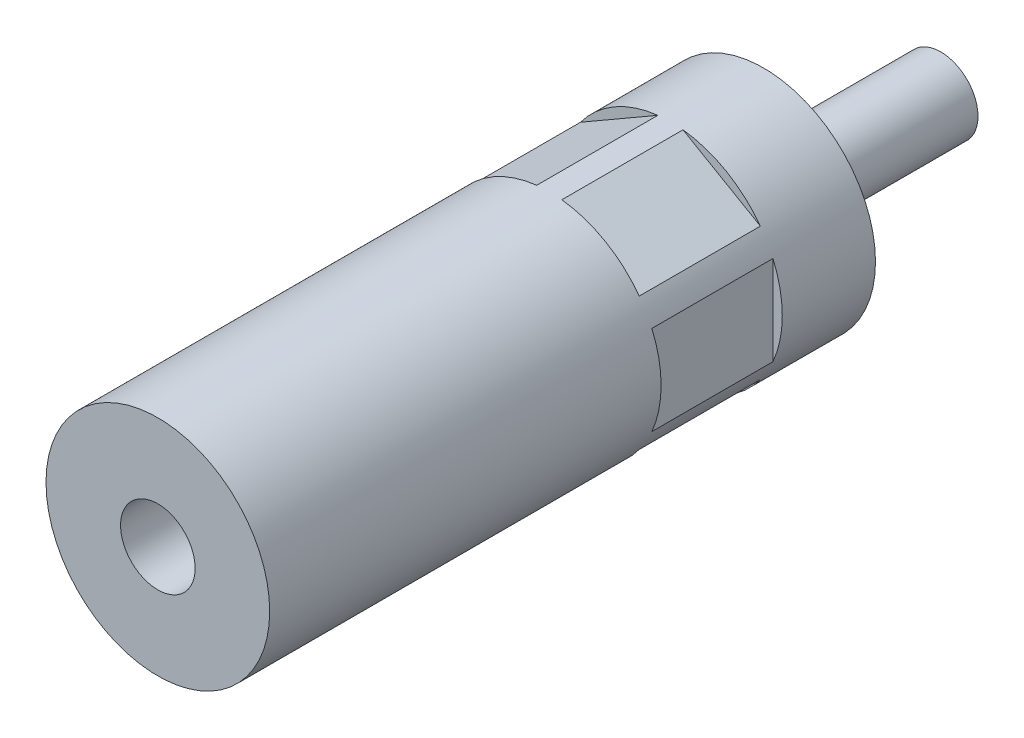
ISO-10303-21;
HEADER;
FILE_DESCRIPTION(('STEP AP214'),'2;1');
FILE_NAME('part.step','',(''),(''),'','','');
FILE_SCHEMA(('AUTOMOTIVE_DESIGN { 1 0 10303 214 1 1 1 1 }'));
ENDSEC;
DATA;
#1=APPLICATION_CONTEXT('core data for automotive mechanical design processes');
#2=APPLICATION_PROTOCOL_DEFINITION('international standard','automotive_design',2000,#1);
#3=PRODUCT_CONTEXT('',#1,'mechanical');
#4=PRODUCT('Part','Part','',(#3));
#5=PRODUCT_RELATED_PRODUCT_CATEGORY('part','',(#4));
#6=PRODUCT_DEFINITION_FORMATION('','',#4);
#7=PRODUCT_DEFINITION_CONTEXT('part definition',#1,'design');
#8=PRODUCT_DEFINITION('design','',#6,#7);
#9=PRODUCT_DEFINITION_SHAPE('','',#8);
#10=(LENGTH_UNIT() NAMED_UNIT(*) SI_UNIT(.MILLI.,.METRE.));
#11=(NAMED_UNIT(*) PLANE_ANGLE_UNIT() SI_UNIT($,.RADIAN.));
#12=(NAMED_UNIT(*) SI_UNIT($,.STERADIAN.) SOLID_ANGLE_UNIT());
#13=UNCERTAINTY_MEASURE_WITH_UNIT(LENGTH_MEASURE(1.E-05),#10,'distance_accuracy_value','');
#14=(GEOMETRIC_REPRESENTATION_CONTEXT(3) GLOBAL_UNCERTAINTY_ASSIGNED_CONTEXT((#13)) GLOBAL_UNIT_ASSIGNED_CONTEXT((#10,
#11,#12)) REPRESENTATION_CONTEXT('',''));
#15=CARTESIAN_POINT('',(0.,0.,0.));
#16=DIRECTION('',(0.,0.,1.));
#17=DIRECTION('',(1.,0.,0.));
#18=AXIS2_PLACEMENT_3D('',#15,#16,#17);
#19=CARTESIAN_POINT('',(0.,0.,80.));
#20=DIRECTION('',(0.,0.,1.));
#21=DIRECTION('',(1.,0.,0.));
#22=AXIS2_PLACEMENT_3D('',#19,#20,#21);
#23=CYLINDRICAL_SURFACE('',#22,12.);
#24=CARTESIAN_POINT('',(0.,0.,10.));
#25=DIRECTION('',(0.,0.,1.));
#26=DIRECTION('',(1.,0.,0.));
#27=AXIS2_PLACEMENT_3D('',#24,#25,#26);
#28=CIRCLE('',#27,12.);
#29=CARTESIAN_POINT('',(-9.653311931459,-7.12836367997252,10.));
#30=VERTEX_POINT('',#29);
#31=CARTESIAN_POINT('',(-1.34668806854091,-11.9241952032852,10.));
#32=VERTEX_POINT('',#31);
#33=EDGE_CURVE('E152',#30,#32,#28,.T.);
#34=ORIENTED_EDGE('',*,*,#33,.F.);
#35=DIRECTION('',(0.,0.,1.));
#36=VECTOR('',#35,1.);
#37=CARTESIAN_POINT('',(-9.65331193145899,-7.12836367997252,80.));
#38=LINE('',#37,#36);
#39=CARTESIAN_POINT('',(-9.653311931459,-7.12836367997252,23.));
#40=VERTEX_POINT('',#39);
#41=EDGE_CURVE('E9',#30,#40,#38,.T.);
#42=ORIENTED_EDGE('',*,*,#41,.T.);
#43=CARTESIAN_POINT('',(0.,0.,23.));
#44=DIRECTION('',(0.,0.,1.));
#45=DIRECTION('',(1.,0.,0.));
#46=AXIS2_PLACEMENT_3D('',#43,#44,#45);
#47=CIRCLE('',#46,12.);
#48=CARTESIAN_POINT('',(-1.34668806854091,-11.9241952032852,23.));
#49=VERTEX_POINT('',#48);
#50=EDGE_CURVE('E22',#40,#49,#47,.T.);
#51=ORIENTED_EDGE('',*,*,#50,.T.);
#52=DIRECTION('',(0.,0.,1.));
#53=VECTOR('',#52,1.);
#54=CARTESIAN_POINT('',(-1.34668806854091,-11.9241952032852,80.));
#55=LINE('',#54,#53);
#56=EDGE_CURVE('E149',#49,#32,#55,.F.);
#57=ORIENTED_EDGE('',*,*,#56,.T.);
#58=EDGE_LOOP('',(#34,#42,#51,#57));
#59=FACE_BOUND('',#58,.T.);
#60=DIRECTION('',(0.,0.,1.));
#61=VECTOR('',#60,1.);
#62=CARTESIAN_POINT('',(11.,4.79583152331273,80.));
#63=LINE('',#62,#61);
#64=CARTESIAN_POINT('',(11.,4.79583152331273,10.));
#65=VERTEX_POINT('',#64);
#66=CARTESIAN_POINT('',(11.,4.79583152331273,23.));
#67=VERTEX_POINT('',#66);
#68=EDGE_CURVE('E142',#65,#67,#63,.T.);
#69=ORIENTED_EDGE('',*,*,#68,.F.);
#70=CARTESIAN_POINT('',(11.,-4.79583152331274,10.));
#71=VERTEX_POINT('',#70);
#72=EDGE_CURVE('E141',#71,#65,#28,.T.);
#73=ORIENTED_EDGE('',*,*,#72,.F.);
#74=DIRECTION('',(0.,0.,1.));
#75=VECTOR('',#74,1.);
#76=CARTESIAN_POINT('',(11.,-4.79583152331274,80.));
#77=LINE('',#76,#75);
#78=CARTESIAN_POINT('',(11.,-4.79583152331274,23.));
#79=VERTEX_POINT('',#78);
#80=EDGE_CURVE('E138',#79,#71,#77,.F.);
#81=ORIENTED_EDGE('',*,*,#80,.F.);
#82=EDGE_CURVE('E145',#79,#67,#47,.T.);
#83=ORIENTED_EDGE('',*,*,#82,.T.);
#84=EDGE_LOOP('',(#69,#73,#81,#83));
#85=FACE_BOUND('',#84,.T.);
#86=CARTESIAN_POINT('',(9.65331193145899,7.12836367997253,10.));
#87=VERTEX_POINT('',#86);
#88=CARTESIAN_POINT('',(1.34668806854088,11.9241952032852,10.));
#89=VERTEX_POINT('',#88);
#90=EDGE_CURVE('E134',#87,#89,#28,.T.);
#91=ORIENTED_EDGE('',*,*,#90,.F.);
#92=DIRECTION('',(0.,0.,1.));
#93=VECTOR('',#92,1.);
#94=CARTESIAN_POINT('',(9.65331193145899,7.12836367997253,80.));
#95=LINE('',#94,#93);
#96=CARTESIAN_POINT('',(9.65331193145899,7.12836367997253,23.));
#97=VERTEX_POINT('',#96);
#98=EDGE_CURVE('E135',#87,#97,#95,.T.);
#99=ORIENTED_EDGE('',*,*,#98,.T.);
#100=CARTESIAN_POINT('',(1.34668806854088,11.9241952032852,23.));
#101=VERTEX_POINT('',#100);
#102=EDGE_CURVE('E139',#97,#101,#47,.T.);
#103=ORIENTED_EDGE('',*,*,#102,.T.);
#104=DIRECTION('',(0.,0.,1.));
#105=VECTOR('',#104,1.);
#106=CARTESIAN_POINT('',(1.34668806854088,11.9241952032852,80.));
#107=LINE('',#106,#105);
#108=EDGE_CURVE('E131',#101,#89,#107,.F.);
#109=ORIENTED_EDGE('',*,*,#108,.T.);
#110=EDGE_LOOP('',(#91,#99,#103,#109));
#111=FACE_BOUND('',#110,.T.);
#112=CARTESIAN_POINT('',(0.,0.,0.));
#113=DIRECTION('',(0.,0.,1.));
#114=DIRECTION('',(1.,0.,0.));
#115=AXIS2_PLACEMENT_3D('',#112,#113,#114);
#116=CIRCLE('',#115,12.);
#117=CARTESIAN_POINT('',(12.,0.,0.));
#118=VERTEX_POINT('',#117);
#119=EDGE_CURVE('E204',#118,#118,#116,.T.);
#120=ORIENTED_EDGE('',*,*,#119,.T.);
#121=EDGE_LOOP('',(#120));
#122=FACE_BOUND('',#121,.T.);
#123=CARTESIAN_POINT('',(0.,0.,65.));
#124=DIRECTION('',(0.,0.,1.));
#125=DIRECTION('',(1.,0.,0.));
#126=AXIS2_PLACEMENT_3D('',#123,#124,#125);
#127=CIRCLE('',#126,12.);
#128=CARTESIAN_POINT('',(12.,0.,65.));
#129=VERTEX_POINT('',#128);
#130=EDGE_CURVE('E201',#129,#129,#127,.T.);
#131=ORIENTED_EDGE('',*,*,#130,.F.);
#132=EDGE_LOOP('',(#131));
#133=FACE_BOUND('',#132,.T.);
#134=CARTESIAN_POINT('',(-11.,4.79583152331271,10.));
#135=VERTEX_POINT('',#134);
#136=CARTESIAN_POINT('',(-11.,-4.79583152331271,10.));
#137=VERTEX_POINT('',#136);
#138=EDGE_CURVE('E111',#135,#137,#28,.T.);
#139=ORIENTED_EDGE('',*,*,#138,.F.);
#140=DIRECTION('',(0.,0.,1.));
#141=VECTOR('',#140,1.);
#142=CARTESIAN_POINT('',(-11.,4.79583152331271,80.));
#143=LINE('',#142,#141);
#144=CARTESIAN_POINT('',(-11.,4.79583152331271,23.));
#145=VERTEX_POINT('',#144);
#146=EDGE_CURVE('E110',#135,#145,#143,.T.);
#147=ORIENTED_EDGE('',*,*,#146,.T.);
#148=CARTESIAN_POINT('',(-11.,-4.79583152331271,23.));
#149=VERTEX_POINT('',#148);
#150=EDGE_CURVE('E103',#145,#149,#47,.T.);
#151=ORIENTED_EDGE('',*,*,#150,.T.);
#152=DIRECTION('',(0.,0.,1.));
#153=VECTOR('',#152,1.);
#154=CARTESIAN_POINT('',(-11.,-4.79583152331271,80.));
#155=LINE('',#154,#153);
#156=EDGE_CURVE('E117',#149,#137,#155,.F.);
#157=ORIENTED_EDGE('',*,*,#156,.T.);
#158=EDGE_LOOP('',(#139,#147,#151,#157));
#159=FACE_BOUND('',#158,.T.);
#160=DIRECTION('',(0.,0.,1.));
#161=VECTOR('',#160,1.);
#162=CARTESIAN_POINT('',(-9.65331193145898,7.12836367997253,80.));
#163=LINE('',#162,#161);
#164=CARTESIAN_POINT('',(-9.65331193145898,7.12836367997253,10.));
#165=VERTEX_POINT('',#164);
#166=CARTESIAN_POINT('',(-9.65331193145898,7.12836367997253,23.));
#167=VERTEX_POINT('',#166);
#168=EDGE_CURVE('E129',#165,#167,#163,.T.);
#169=ORIENTED_EDGE('',*,*,#168,.F.);
#170=CARTESIAN_POINT('',(-1.3466880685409,11.9241952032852,10.));
#171=VERTEX_POINT('',#170);
#172=EDGE_CURVE('E125',#171,#165,#28,.T.);
#173=ORIENTED_EDGE('',*,*,#172,.F.);
#174=DIRECTION('',(0.,0.,1.));
#175=VECTOR('',#174,1.);
#176=CARTESIAN_POINT('',(-1.3466880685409,11.9241952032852,80.));
#177=LINE('',#176,#175);
#178=CARTESIAN_POINT('',(-1.3466880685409,11.9241952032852,23.));
#179=VERTEX_POINT('',#178);
#180=EDGE_CURVE('E123',#179,#171,#177,.F.);
#181=ORIENTED_EDGE('',*,*,#180,.F.);
#182=EDGE_CURVE('E113',#179,#167,#47,.T.);
#183=ORIENTED_EDGE('',*,*,#182,.T.);
#184=EDGE_LOOP('',(#169,#173,#181,#183));
#185=FACE_BOUND('',#184,.T.);
#186=DIRECTION('',(0.,0.,1.));
#187=VECTOR('',#186,1.);
#188=CARTESIAN_POINT('',(9.65331193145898,-7.12836367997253,80.));
#189=LINE('',#188,#187);
#190=CARTESIAN_POINT('',(9.65331193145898,-7.12836367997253,10.));
#191=VERTEX_POINT('',#190);
#192=CARTESIAN_POINT('',(9.65331193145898,-7.12836367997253,23.));
#193=VERTEX_POINT('',#192);
#194=EDGE_CURVE('E148',#191,#193,#189,.T.);
#195=ORIENTED_EDGE('',*,*,#194,.F.);
#196=CARTESIAN_POINT('',(1.34668806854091,-11.9241952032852,10.));
#197=VERTEX_POINT('',#196);
#198=EDGE_CURVE('E147',#197,#191,#28,.T.);
#199=ORIENTED_EDGE('',*,*,#198,.F.);
#200=DIRECTION('',(0.,0.,1.));
#201=VECTOR('',#200,1.);
#202=CARTESIAN_POINT('',(1.34668806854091,-11.9241952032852,80.));
#203=LINE('',#202,#201);
#204=CARTESIAN_POINT('',(1.34668806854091,-11.9241952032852,23.));
#205=VERTEX_POINT('',#204);
#206=EDGE_CURVE('E144',#205,#197,#203,.F.);
#207=ORIENTED_EDGE('',*,*,#206,.F.);
#208=EDGE_CURVE('E150',#205,#193,#47,.T.);
#209=ORIENTED_EDGE('',*,*,#208,.T.);
#210=EDGE_LOOP('',(#195,#199,#207,#209));
#211=FACE_BOUND('',#210,.T.);
#212=ADVANCED_FACE('F14',(#59,#85,#111,#122,#133,#159,#185,#211),#23,.T.);
#213=CARTESIAN_POINT('',(0.,0.,-19.));
#214=DIRECTION('',(0.,0.,1.));
#215=DIRECTION('',(1.,0.,0.));
#216=AXIS2_PLACEMENT_3D('',#213,#214,#215);
#217=PLANE('',#216);
#218=CARTESIAN_POINT('',(0.,0.,-19.));
#219=DIRECTION('',(0.,0.,1.));
#220=DIRECTION('',(1.,0.,0.));
#221=AXIS2_PLACEMENT_3D('',#218,#219,#220);
#222=CIRCLE('',#221,4.);
#223=CARTESIAN_POINT('',(4.,0.,-19.));
#224=VERTEX_POINT('',#223);
#225=EDGE_CURVE('E159',#224,#224,#222,.T.);
#226=ORIENTED_EDGE('',*,*,#225,.F.);
#227=EDGE_LOOP('',(#226));
#228=FACE_BOUND('',#227,.T.);
#229=ADVANCED_FACE('F16',(#228),#217,.F.);
#230=CARTESIAN_POINT('',(0.,0.,80.));
#231=DIRECTION('',(0.,0.,1.));
#232=DIRECTION('',(1.,0.,0.));
#233=AXIS2_PLACEMENT_3D('',#230,#231,#232);
#234=CYLINDRICAL_SURFACE('',#233,4.);
#235=CARTESIAN_POINT('',(0.,0.,-2.5));
#236=DIRECTION('',(0.,0.,1.));
#237=DIRECTION('',(1.,0.,0.));
#238=AXIS2_PLACEMENT_3D('',#235,#236,#237);
#239=CIRCLE('',#238,4.);
#240=CARTESIAN_POINT('',(4.,0.,-2.5));
#241=VERTEX_POINT('',#240);
#242=EDGE_CURVE('E213',#241,#241,#239,.T.);
#243=ORIENTED_EDGE('',*,*,#242,.F.);
#244=EDGE_LOOP('',(#243));
#245=FACE_BOUND('',#244,.T.);
#246=ORIENTED_EDGE('',*,*,#225,.T.);
#247=EDGE_LOOP('',(#246));
#248=FACE_BOUND('',#247,.T.);
#249=ADVANCED_FACE('F219',(#245,#248),#234,.T.);
#250=CARTESIAN_POINT('',(3.25,0.,-2.5));
#251=DIRECTION('',(0.,0.,1.));
#252=DIRECTION('',(1.,0.,0.));
#253=AXIS2_PLACEMENT_3D('',#250,#251,#252);
#254=PLANE('',#253);
#255=ORIENTED_EDGE('',*,*,#242,.T.);
#256=EDGE_LOOP('',(#255));
#257=FACE_BOUND('',#256,.T.);
#258=CARTESIAN_POINT('',(0.,0.,-2.5));
#259=DIRECTION('',(0.,0.,1.));
#260=DIRECTION('',(1.,0.,0.));
#261=AXIS2_PLACEMENT_3D('',#258,#259,#260);
#262=CIRCLE('',#261,3.25);
#263=CARTESIAN_POINT('',(3.25,0.,-2.5));
#264=VERTEX_POINT('',#263);
#265=EDGE_CURVE('E210',#264,#264,#262,.T.);
#266=ORIENTED_EDGE('',*,*,#265,.F.);
#267=EDGE_LOOP('',(#266));
#268=FACE_BOUND('',#267,.T.);
#269=ADVANCED_FACE('F227',(#257,#268),#254,.T.);
#270=CARTESIAN_POINT('',(0.,0.,80.));
#271=DIRECTION('',(0.,0.,1.));
#272=DIRECTION('',(1.,0.,0.));
#273=AXIS2_PLACEMENT_3D('',#270,#271,#272);
#274=CYLINDRICAL_SURFACE('',#273,3.25);
#275=ORIENTED_EDGE('',*,*,#265,.T.);
#276=EDGE_LOOP('',(#275));
#277=FACE_BOUND('',#276,.T.);
#278=CARTESIAN_POINT('',(0.,0.,0.));
#279=DIRECTION('',(0.,0.,1.));
#280=DIRECTION('',(1.,0.,0.));
#281=AXIS2_PLACEMENT_3D('',#278,#279,#280);
#282=CIRCLE('',#281,3.25);
#283=CARTESIAN_POINT('',(3.25,0.,0.));
#284=VERTEX_POINT('',#283);
#285=EDGE_CURVE('E207',#284,#284,#282,.T.);
#286=ORIENTED_EDGE('',*,*,#285,.F.);
#287=EDGE_LOOP('',(#286));
#288=FACE_BOUND('',#287,.T.);
#289=ADVANCED_FACE('F239',(#277,#288),#274,.T.);
#290=CARTESIAN_POINT('',(12.,0.,0.));
#291=DIRECTION('',(0.,0.,-1.));
#292=DIRECTION('',(-1.,0.,0.));
#293=AXIS2_PLACEMENT_3D('',#290,#291,#292);
#294=PLANE('',#293);
#295=ORIENTED_EDGE('',*,*,#285,.T.);
#296=EDGE_LOOP('',(#295));
#297=FACE_BOUND('',#296,.T.);
#298=ORIENTED_EDGE('',*,*,#119,.F.);
#299=EDGE_LOOP('',(#298));
#300=FACE_BOUND('',#299,.T.);
#301=ADVANCED_FACE('F236',(#297,#300),#294,.T.);
#302=CARTESIAN_POINT('',(12.,0.,65.));
#303=DIRECTION('',(0.,0.,-1.));
#304=DIRECTION('',(-1.,0.,0.));
#305=AXIS2_PLACEMENT_3D('',#302,#303,#304);
#306=PLANE('',#305);
#307=CARTESIAN_POINT('',(0.,0.,65.));
#308=DIRECTION('',(0.,0.,1.));
#309=DIRECTION('',(1.,0.,0.));
#310=AXIS2_PLACEMENT_3D('',#307,#308,#309);
#311=CIRCLE('',#310,4.);
#312=CARTESIAN_POINT('',(4.,0.,65.));
#313=VERTEX_POINT('',#312);
#314=EDGE_CURVE('E190',#313,#313,#311,.T.);
#315=ORIENTED_EDGE('',*,*,#314,.F.);
#316=EDGE_LOOP('',(#315));
#317=FACE_BOUND('',#316,.T.);
#318=ORIENTED_EDGE('',*,*,#130,.T.);
#319=EDGE_LOOP('',(#318));
#320=FACE_BOUND('',#319,.T.);
#321=ADVANCED_FACE('F234',(#317,#320),#306,.F.);
#322=CARTESIAN_POINT('',(0.,0.,80.));
#323=DIRECTION('',(0.,0.,1.));
#324=DIRECTION('',(1.,0.,0.));
#325=AXIS2_PLACEMENT_3D('',#322,#323,#324);
#326=CYLINDRICAL_SURFACE('',#325,4.);
#327=CARTESIAN_POINT('',(0.,0.,45.));
#328=DIRECTION('',(0.,0.,1.));
#329=DIRECTION('',(1.,0.,0.));
#330=AXIS2_PLACEMENT_3D('',#327,#328,#329);
#331=CIRCLE('',#330,4.);
#332=CARTESIAN_POINT('',(4.,0.,45.));
#333=VERTEX_POINT('',#332);
#334=EDGE_CURVE('E312',#333,#333,#331,.T.);
#335=ORIENTED_EDGE('',*,*,#334,.F.);
#336=EDGE_LOOP('',(#335));
#337=FACE_BOUND('',#336,.T.);
#338=ORIENTED_EDGE('',*,*,#314,.T.);
#339=EDGE_LOOP('',(#338));
#340=FACE_BOUND('',#339,.T.);
#341=ADVANCED_FACE('F260',(#337,#340),#326,.F.);
#342=CARTESIAN_POINT('',(-11.,6.35085296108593,23.));
#343=DIRECTION('',(1.,0.,0.));
#344=DIRECTION('',(0.,0.,-1.));
#345=AXIS2_PLACEMENT_3D('',#342,#343,#344);
#346=PLANE('',#345);
#347=DIRECTION('',(0.,-1.,0.));
#348=VECTOR('',#347,1.);
#349=CARTESIAN_POINT('',(-11.,6.35085296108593,10.));
#350=LINE('',#349,#348);
#351=EDGE_CURVE('E313',#135,#137,#350,.T.);
#352=ORIENTED_EDGE('',*,*,#351,.T.);
#353=ORIENTED_EDGE('',*,*,#156,.F.);
#354=DIRECTION('',(0.,-1.,0.));
#355=VECTOR('',#354,1.);
#356=CARTESIAN_POINT('',(-11.,6.35085296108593,23.));
#357=LINE('',#356,#355);
#358=EDGE_CURVE('E106',#145,#149,#357,.T.);
#359=ORIENTED_EDGE('',*,*,#358,.F.);
#360=ORIENTED_EDGE('',*,*,#146,.F.);
#361=EDGE_LOOP('',(#352,#353,#359,#360));
#362=FACE_BOUND('',#361,.T.);
#363=ADVANCED_FACE('F115',(#362),#346,.F.);
#364=CARTESIAN_POINT('',(0.,0.,10.));
#365=DIRECTION('',(0.,0.,1.));
#366=DIRECTION('',(1.,0.,0.));
#367=AXIS2_PLACEMENT_3D('',#364,#365,#366);
#368=PLANE('',#367);
#369=ORIENTED_EDGE('',*,*,#138,.T.);
#370=ORIENTED_EDGE('',*,*,#351,.F.);
#371=EDGE_LOOP('',(#369,#370));
#372=FACE_BOUND('',#371,.T.);
#373=ADVANCED_FACE('F271',(#372),#368,.T.);
#374=CARTESIAN_POINT('',(0.,0.,23.));
#375=DIRECTION('',(0.,0.,1.));
#376=DIRECTION('',(1.,0.,0.));
#377=AXIS2_PLACEMENT_3D('',#374,#375,#376);
#378=PLANE('',#377);
#379=ORIENTED_EDGE('',*,*,#358,.T.);
#380=ORIENTED_EDGE('',*,*,#150,.F.);
#381=EDGE_LOOP('',(#379,#380));
#382=FACE_BOUND('',#381,.T.);
#383=ADVANCED_FACE('F105',(#382),#378,.F.);
#384=CARTESIAN_POINT('',(-11.,6.35085296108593,23.));
#385=DIRECTION('',(-0.5,0.866025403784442,0.));
#386=DIRECTION('',(-0.866025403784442,-0.5,0.));
#387=AXIS2_PLACEMENT_3D('',#384,#385,#386);
#388=PLANE('',#387);
#389=ORIENTED_EDGE('',*,*,#168,.T.);
#390=DIRECTION('',(0.866025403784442,0.5,0.));
#391=VECTOR('',#390,1.);
#392=CARTESIAN_POINT('',(-11.,6.35085296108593,23.));
#393=LINE('',#392,#391);
#394=EDGE_CURVE('E118',#167,#179,#393,.T.);
#395=ORIENTED_EDGE('',*,*,#394,.T.);
#396=ORIENTED_EDGE('',*,*,#180,.T.);
#397=DIRECTION('',(0.866025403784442,0.5,0.));
#398=VECTOR('',#397,1.);
#399=CARTESIAN_POINT('',(-11.,6.35085296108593,10.));
#400=LINE('',#399,#398);
#401=EDGE_CURVE('E315',#165,#171,#400,.T.);
#402=ORIENTED_EDGE('',*,*,#401,.F.);
#403=EDGE_LOOP('',(#389,#395,#396,#402));
#404=FACE_BOUND('',#403,.T.);
#405=ADVANCED_FACE('F298',(#404),#388,.T.);
#406=ORIENTED_EDGE('',*,*,#172,.T.);
#407=ORIENTED_EDGE('',*,*,#401,.T.);
#408=EDGE_LOOP('',(#406,#407));
#409=FACE_BOUND('',#408,.T.);
#410=ADVANCED_FACE('F286',(#409),#368,.T.);
#411=ORIENTED_EDGE('',*,*,#394,.F.);
#412=ORIENTED_EDGE('',*,*,#182,.F.);
#413=EDGE_LOOP('',(#411,#412));
#414=FACE_BOUND('',#413,.T.);
#415=ADVANCED_FACE('F281',(#414),#378,.F.);
#416=CARTESIAN_POINT('',(11.,6.35085296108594,23.));
#417=DIRECTION('',(-0.499999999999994,-0.866025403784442,0.));
#418=DIRECTION('',(0.866025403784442,-0.499999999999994,0.));
#419=AXIS2_PLACEMENT_3D('',#416,#417,#418);
#420=PLANE('',#419);
#421=DIRECTION('',(-0.866025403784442,0.499999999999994,0.));
#422=VECTOR('',#421,1.);
#423=CARTESIAN_POINT('',(11.,6.35085296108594,10.));
#424=LINE('',#423,#422);
#425=EDGE_CURVE('E323',#87,#89,#424,.T.);
#426=ORIENTED_EDGE('',*,*,#425,.T.);
#427=ORIENTED_EDGE('',*,*,#108,.F.);
#428=DIRECTION('',(-0.866025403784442,0.499999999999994,0.));
#429=VECTOR('',#428,1.);
#430=CARTESIAN_POINT('',(11.,6.35085296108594,23.));
#431=LINE('',#430,#429);
#432=EDGE_CURVE('E192',#97,#101,#431,.T.);
#433=ORIENTED_EDGE('',*,*,#432,.F.);
#434=ORIENTED_EDGE('',*,*,#98,.F.);
#435=EDGE_LOOP('',(#426,#427,#433,#434));
#436=FACE_BOUND('',#435,.T.);
#437=ADVANCED_FACE('F285',(#436),#420,.F.);
#438=ORIENTED_EDGE('',*,*,#90,.T.);
#439=ORIENTED_EDGE('',*,*,#425,.F.);
#440=EDGE_LOOP('',(#438,#439));
#441=FACE_BOUND('',#440,.T.);
#442=ADVANCED_FACE('F279',(#441),#368,.T.);
#443=ORIENTED_EDGE('',*,*,#432,.T.);
#444=ORIENTED_EDGE('',*,*,#102,.F.);
#445=EDGE_LOOP('',(#443,#444));
#446=FACE_BOUND('',#445,.T.);
#447=ADVANCED_FACE('F275',(#446),#378,.F.);
#448=CARTESIAN_POINT('',(11.,6.35085296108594,23.));
#449=DIRECTION('',(1.,0.,0.));
#450=DIRECTION('',(0.,1.,0.));
#451=AXIS2_PLACEMENT_3D('',#448,#449,#450);
#452=PLANE('',#451);
#453=ORIENTED_EDGE('',*,*,#68,.T.);
#454=DIRECTION('',(0.,-1.,0.));
#455=VECTOR('',#454,1.);
#456=CARTESIAN_POINT('',(11.,6.35085296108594,23.));
#457=LINE('',#456,#455);
#458=EDGE_CURVE('E187',#67,#79,#457,.T.);
#459=ORIENTED_EDGE('',*,*,#458,.T.);
#460=ORIENTED_EDGE('',*,*,#80,.T.);
#461=DIRECTION('',(0.,-1.,0.));
#462=VECTOR('',#461,1.);
#463=CARTESIAN_POINT('',(11.,6.35085296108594,10.));
#464=LINE('',#463,#462);
#465=EDGE_CURVE('E322',#65,#71,#464,.T.);
#466=ORIENTED_EDGE('',*,*,#465,.F.);
#467=EDGE_LOOP('',(#453,#459,#460,#466));
#468=FACE_BOUND('',#467,.T.);
#469=ADVANCED_FACE('F278',(#468),#452,.T.);
#470=ORIENTED_EDGE('',*,*,#72,.T.);
#471=ORIENTED_EDGE('',*,*,#465,.T.);
#472=EDGE_LOOP('',(#470,#471));
#473=FACE_BOUND('',#472,.T.);
#474=ADVANCED_FACE('F287',(#473),#368,.T.);
#475=ORIENTED_EDGE('',*,*,#458,.F.);
#476=ORIENTED_EDGE('',*,*,#82,.F.);
#477=EDGE_LOOP('',(#475,#476));
#478=FACE_BOUND('',#477,.T.);
#479=ADVANCED_FACE('F282',(#478),#378,.F.);
#480=CARTESIAN_POINT('',(11.,-6.35085296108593,23.));
#481=DIRECTION('',(0.5,-0.866025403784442,0.));
#482=DIRECTION('',(0.866025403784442,0.5,0.));
#483=AXIS2_PLACEMENT_3D('',#480,#481,#482);
#484=PLANE('',#483);
#485=ORIENTED_EDGE('',*,*,#194,.T.);
#486=DIRECTION('',(-0.866025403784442,-0.5,0.));
#487=VECTOR('',#486,1.);
#488=CARTESIAN_POINT('',(11.,-6.35085296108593,23.));
#489=LINE('',#488,#487);
#490=EDGE_CURVE('E37',#193,#205,#489,.T.);
#491=ORIENTED_EDGE('',*,*,#490,.T.);
#492=ORIENTED_EDGE('',*,*,#206,.T.);
#493=DIRECTION('',(-0.866025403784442,-0.5,0.));
#494=VECTOR('',#493,1.);
#495=CARTESIAN_POINT('',(11.,-6.35085296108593,10.));
#496=LINE('',#495,#494);
#497=EDGE_CURVE('E319',#191,#197,#496,.T.);
#498=ORIENTED_EDGE('',*,*,#497,.F.);
#499=EDGE_LOOP('',(#485,#491,#492,#498));
#500=FACE_BOUND('',#499,.T.);
#501=ADVANCED_FACE('F288',(#500),#484,.T.);
#502=ORIENTED_EDGE('',*,*,#198,.T.);
#503=ORIENTED_EDGE('',*,*,#497,.T.);
#504=EDGE_LOOP('',(#502,#503));
#505=FACE_BOUND('',#504,.T.);
#506=ADVANCED_FACE('F291',(#505),#368,.T.);
#507=ORIENTED_EDGE('',*,*,#490,.F.);
#508=ORIENTED_EDGE('',*,*,#208,.F.);
#509=EDGE_LOOP('',(#507,#508));
#510=FACE_BOUND('',#509,.T.);
#511=ADVANCED_FACE('F185',(#510),#378,.F.);
#512=DIRECTION('',(0.866025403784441,-0.5,0.));
#513=VECTOR('',#512,1.);
#514=CARTESIAN_POINT('',(-11.,-6.35085296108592,23.));
#515=LINE('',#514,#513);
#516=EDGE_CURVE('E186',#40,#49,#515,.T.);
#517=ORIENTED_EDGE('',*,*,#516,.T.);
#518=ORIENTED_EDGE('',*,*,#50,.F.);
#519=EDGE_LOOP('',(#517,#518));
#520=FACE_BOUND('',#519,.T.);
#521=ADVANCED_FACE('F335',(#520),#378,.F.);
#522=ORIENTED_EDGE('',*,*,#33,.T.);
#523=DIRECTION('',(0.866025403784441,-0.5,0.));
#524=VECTOR('',#523,1.);
#525=CARTESIAN_POINT('',(-11.,-6.35085296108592,10.));
#526=LINE('',#525,#524);
#527=EDGE_CURVE('E29',#30,#32,#526,.T.);
#528=ORIENTED_EDGE('',*,*,#527,.F.);
#529=EDGE_LOOP('',(#522,#528));
#530=FACE_BOUND('',#529,.T.);
#531=ADVANCED_FACE('F306',(#530),#368,.T.);
#532=CARTESIAN_POINT('',(-11.,-6.35085296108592,23.));
#533=DIRECTION('',(0.5,0.866025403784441,0.));
#534=DIRECTION('',(-0.866025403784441,0.5,0.));
#535=AXIS2_PLACEMENT_3D('',#532,#533,#534);
#536=PLANE('',#535);
#537=ORIENTED_EDGE('',*,*,#527,.T.);
#538=ORIENTED_EDGE('',*,*,#56,.F.);
#539=ORIENTED_EDGE('',*,*,#516,.F.);
#540=ORIENTED_EDGE('',*,*,#41,.F.);
#541=EDGE_LOOP('',(#537,#538,#539,#540));
#542=FACE_BOUND('',#541,.T.);
#543=ADVANCED_FACE('F302',(#542),#536,.F.);
#544=CARTESIAN_POINT('',(0.,0.,45.));
#545=DIRECTION('',(0.,0.,1.));
#546=DIRECTION('',(1.,0.,0.));
#547=AXIS2_PLACEMENT_3D('',#544,#545,#546);
#548=PLANE('',#547);
#549=ORIENTED_EDGE('',*,*,#334,.T.);
#550=EDGE_LOOP('',(#549));
#551=FACE_BOUND('',#550,.T.);
#552=ADVANCED_FACE('F305',(#551),#548,.T.);
#553=CLOSED_SHELL('',(#212,#229,#249,#269,#289,#301,#321,#341,#363,#373,#383,#405,#410,#415,
#437,#442,#447,#469,#474,#479,#501,#506,#511,#521,#531,#543,#552));
#554=MANIFOLD_SOLID_BREP('B1',#553);
#555=ADVANCED_BREP_SHAPE_REPRESENTATION('',(#18,#554),#14);
#556=SHAPE_DEFINITION_REPRESENTATION(#9,#555);
ENDSEC;
END-ISO-10303-21;
